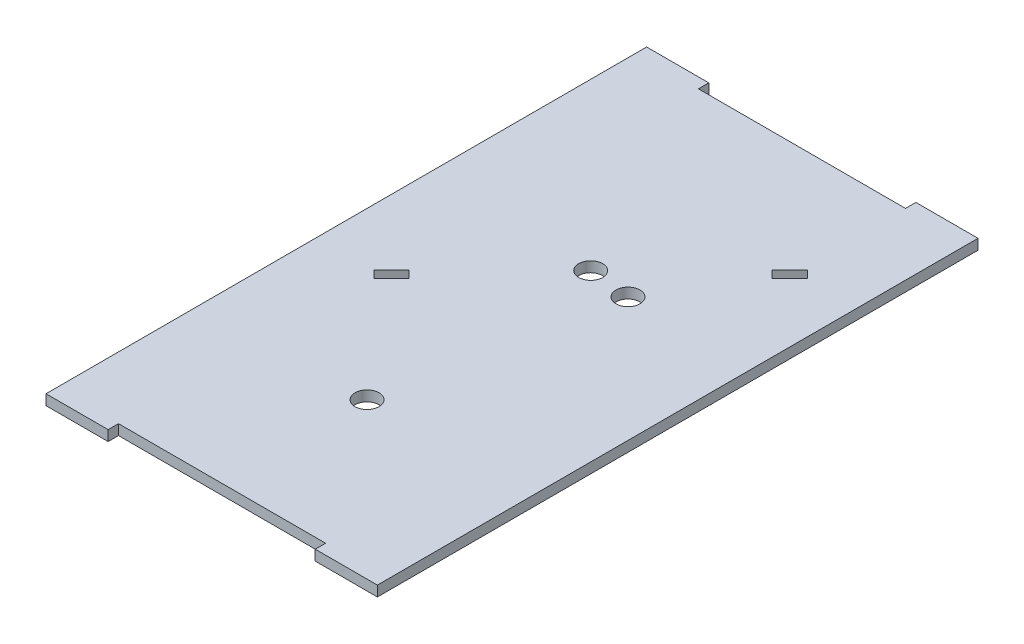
from build123d import *

# Parameters (mm, degrees)
SKETCH1_W           = 101.6
SKETCH1_H           = 177.8
BOSS_EXTRUDE1_DEPTH = 3.175
SKETCH2_W           = 19.05
SKETCH2_H           = 3.175
BOSS_EXTRUDE2_DEPTH = 3.175
SKETCH4_R           = 3.683
CUT_EXTRUDE2_DEPTH  = 208.568280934
CUT_EXTRUDE4_DEPTH  = 208.568280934


with BuildPart() as part:
    # Sketch1 → Boss-Extrude1 (new body)
    with BuildSketch(Plane(origin=(0, 0, 0), x_dir=(1, 0, 0), z_dir=(0, 1, 0))):
        with Locations((50.8, 88.9)):
            Rectangle(SKETCH1_W, SKETCH1_H)
    extrude(amount=BOSS_EXTRUDE1_DEPTH)

    # Sketch2 → Boss-Extrude2 (add)
    with BuildSketch(Plane(origin=(0, 0, 0), x_dir=(1, 0, 0), z_dir=(0, 1, 0))):
        with Locations((9.525, 179.3875)):
            Rectangle(SKETCH2_W, SKETCH2_H)
        with Locations((92.075, 179.3875)):
            Rectangle(SKETCH2_W, SKETCH2_H)
        with Locations((92.075, -1.5875)):
            Rectangle(SKETCH2_W, SKETCH2_H)
        with Locations((9.525, -1.5875)):
            Rectangle(SKETCH2_W, SKETCH2_H)
    extrude(amount=BOSS_EXTRUDE2_DEPTH)

    # Sketch4 → Cut-Extrude2 (cut, through all)
    with BuildSketch(Plane(origin=(0, 3.175, 0), x_dir=(1, 0, 0), z_dir=(0, 1, 0))):
        with Locations(Location((63.5, 111.76, 0), (0, 0, 270))):
            Circle(SKETCH4_R)
        with Locations(Location((50.8, 44.45, 0), (0, 0, 270))):
            Circle(SKETCH4_R)
        with Locations(Location((50.8, 113.03, 0), (0, 0, 270))):
            Circle(SKETCH4_R)
    extrude(amount=-CUT_EXTRUDE2_DEPTH, mode=Mode.SUBTRACT)

    # Sketch5 → Cut-Extrude4 (cut, through all)
    with BuildSketch(Plane(origin=(0, 3.175, 0), x_dir=(1, 0, 0), z_dir=(0, 1, 0))):
        Polygon((17.425731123, 79.983398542), (22.813884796, 85.371552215), (25.058948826, 83.126488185), (19.670795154, 77.738334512), align=None)
        Polygon((78.458447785, 141.016115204), (80.703511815, 138.771051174), (86.091665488, 144.159204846), (83.846601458, 146.404268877), align=None)
    extrude(amount=-CUT_EXTRUDE4_DEPTH, mode=Mode.SUBTRACT)


solid = part.part
